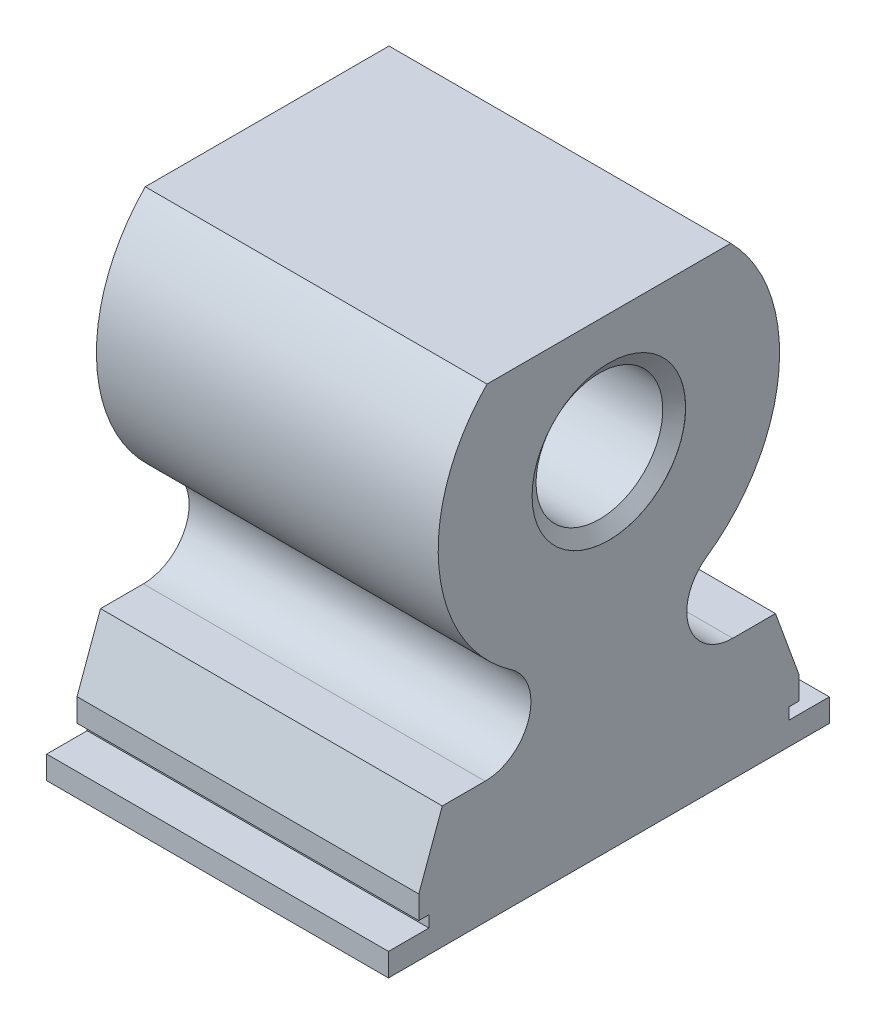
ISO-10303-21;
HEADER;
FILE_DESCRIPTION(('STEP AP214'),'2;1');
FILE_NAME('part.step','',(''),(''),'','','');
FILE_SCHEMA(('AUTOMOTIVE_DESIGN { 1 0 10303 214 1 1 1 1 }'));
ENDSEC;
DATA;
#1=APPLICATION_CONTEXT('core data for automotive mechanical design processes');
#2=APPLICATION_PROTOCOL_DEFINITION('international standard','automotive_design',2000,#1);
#3=PRODUCT_CONTEXT('',#1,'mechanical');
#4=PRODUCT('Part','Part','',(#3));
#5=PRODUCT_RELATED_PRODUCT_CATEGORY('part','',(#4));
#6=PRODUCT_DEFINITION_FORMATION('','',#4);
#7=PRODUCT_DEFINITION_CONTEXT('part definition',#1,'design');
#8=PRODUCT_DEFINITION('design','',#6,#7);
#9=PRODUCT_DEFINITION_SHAPE('','',#8);
#10=(LENGTH_UNIT() NAMED_UNIT(*) SI_UNIT(.MILLI.,.METRE.));
#11=(NAMED_UNIT(*) PLANE_ANGLE_UNIT() SI_UNIT($,.RADIAN.));
#12=(NAMED_UNIT(*) SI_UNIT($,.STERADIAN.) SOLID_ANGLE_UNIT());
#13=UNCERTAINTY_MEASURE_WITH_UNIT(LENGTH_MEASURE(1.E-05),#10,'distance_accuracy_value','');
#14=(GEOMETRIC_REPRESENTATION_CONTEXT(3) GLOBAL_UNCERTAINTY_ASSIGNED_CONTEXT((#13)) GLOBAL_UNIT_ASSIGNED_CONTEXT((#10,
#11,#12)) REPRESENTATION_CONTEXT('',''));
#15=CARTESIAN_POINT('',(0.,0.,0.));
#16=DIRECTION('',(0.,0.,1.));
#17=DIRECTION('',(1.,0.,0.));
#18=AXIS2_PLACEMENT_3D('',#15,#16,#17);
#19=CARTESIAN_POINT('',(8.9,0.,0.));
#20=DIRECTION('',(-1.,0.,0.));
#21=DIRECTION('',(0.,0.,1.));
#22=AXIS2_PLACEMENT_3D('',#19,#20,#21);
#23=CYLINDRICAL_SURFACE('',#22,4.445);
#24=CARTESIAN_POINT('',(8.9,0.,0.));
#25=DIRECTION('',(1.,0.,0.));
#26=DIRECTION('',(0.,0.,-1.));
#27=AXIS2_PLACEMENT_3D('',#24,#25,#26);
#28=CIRCLE('',#27,4.445);
#29=CARTESIAN_POINT('',(8.9,3.1115,3.1743649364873));
#30=VERTEX_POINT('',#29);
#31=CARTESIAN_POINT('',(8.9,-3.64692729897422,2.5412489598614));
#32=VERTEX_POINT('',#31);
#33=EDGE_CURVE('E313',#30,#32,#28,.T.);
#34=ORIENTED_EDGE('',*,*,#33,.F.);
#35=DIRECTION('',(-1.,0.,0.));
#36=VECTOR('',#35,1.);
#37=CARTESIAN_POINT('',(8.9,3.1115,3.1743649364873));
#38=LINE('',#37,#36);
#39=CARTESIAN_POINT('',(0.,3.1115,3.1743649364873));
#40=VERTEX_POINT('',#39);
#41=EDGE_CURVE('E11',#30,#40,#38,.T.);
#42=ORIENTED_EDGE('',*,*,#41,.T.);
#43=CARTESIAN_POINT('',(0.,0.,0.));
#44=DIRECTION('',(1.,0.,0.));
#45=DIRECTION('',(0.,0.,-1.));
#46=AXIS2_PLACEMENT_3D('',#43,#44,#45);
#47=CIRCLE('',#46,4.445);
#48=CARTESIAN_POINT('',(0.,-3.64692729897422,2.5412489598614));
#49=VERTEX_POINT('',#48);
#50=EDGE_CURVE('E232',#40,#49,#47,.T.);
#51=ORIENTED_EDGE('',*,*,#50,.T.);
#52=DIRECTION('',(-1.,0.,0.));
#53=VECTOR('',#52,1.);
#54=CARTESIAN_POINT('',(8.9,-3.64692729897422,2.5412489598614));
#55=LINE('',#54,#53);
#56=EDGE_CURVE('E261',#32,#49,#55,.T.);
#57=ORIENTED_EDGE('',*,*,#56,.F.);
#58=EDGE_LOOP('',(#34,#42,#51,#57));
#59=FACE_BOUND('',#58,.T.);
#60=ADVANCED_FACE('F39',(#59),#23,.T.);
#61=CARTESIAN_POINT('',(8.9,0.,0.));
#62=DIRECTION('',(-1.,0.,0.));
#63=DIRECTION('',(0.,0.,1.));
#64=AXIS2_PLACEMENT_3D('',#61,#62,#63);
#65=CYLINDRICAL_SURFACE('',#64,1.65);
#66=CARTESIAN_POINT('',(0.247521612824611,0.,0.));
#67=DIRECTION('',(-1.,0.,0.));
#68=DIRECTION('',(0.,0.,1.));
#69=AXIS2_PLACEMENT_3D('',#66,#67,#68);
#70=CIRCLE('',#69,1.65);
#71=CARTESIAN_POINT('',(0.247521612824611,0.,1.65));
#72=VERTEX_POINT('',#71);
#73=EDGE_CURVE('E295',#72,#72,#70,.T.);
#74=ORIENTED_EDGE('',*,*,#73,.T.);
#75=EDGE_LOOP('',(#74));
#76=FACE_BOUND('',#75,.T.);
#77=CARTESIAN_POINT('',(8.65247838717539,0.,0.));
#78=DIRECTION('',(-1.,0.,0.));
#79=DIRECTION('',(0.,0.,1.));
#80=AXIS2_PLACEMENT_3D('',#77,#78,#79);
#81=CIRCLE('',#80,1.65);
#82=CARTESIAN_POINT('',(8.65247838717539,0.,1.65));
#83=VERTEX_POINT('',#82);
#84=EDGE_CURVE('E373',#83,#83,#81,.T.);
#85=ORIENTED_EDGE('',*,*,#84,.F.);
#86=EDGE_LOOP('',(#85));
#87=FACE_BOUND('',#86,.T.);
#88=ADVANCED_FACE('F385',(#76,#87),#65,.F.);
#89=CARTESIAN_POINT('',(8.9,-4.62630314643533,3.22369685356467));
#90=DIRECTION('',(-1.,0.,0.));
#91=DIRECTION('',(0.,0.,1.));
#92=AXIS2_PLACEMENT_3D('',#89,#90,#91);
#93=PLANE('',#92);
#94=CARTESIAN_POINT('',(8.9,-3.64692729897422,-2.5412489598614));
#95=VERTEX_POINT('',#94);
#96=CARTESIAN_POINT('',(8.9,3.1115,-3.1743649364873));
#97=VERTEX_POINT('',#96);
#98=EDGE_CURVE('E303',#95,#97,#28,.T.);
#99=ORIENTED_EDGE('',*,*,#98,.T.);
#100=DIRECTION('',(0.,0.,1.));
#101=VECTOR('',#100,1.);
#102=CARTESIAN_POINT('',(8.9,3.1115,-4.445));
#103=LINE('',#102,#101);
#104=EDGE_CURVE('E54',#97,#30,#103,.T.);
#105=ORIENTED_EDGE('',*,*,#104,.T.);
#106=ORIENTED_EDGE('',*,*,#33,.T.);
#107=CARTESIAN_POINT('',(8.9,-4.62630314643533,3.22369685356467));
#108=DIRECTION('',(-1.,0.,0.));
#109=DIRECTION('',(0.,0.,1.));
#110=AXIS2_PLACEMENT_3D('',#107,#108,#109);
#111=CIRCLE('',#110,1.19369685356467);
#112=CARTESIAN_POINT('',(8.9,-5.82,3.22369685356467));
#113=VERTEX_POINT('',#112);
#114=EDGE_CURVE('E312',#32,#113,#111,.T.);
#115=ORIENTED_EDGE('',*,*,#114,.T.);
#116=DIRECTION('',(0.,0.,1.));
#117=VECTOR('',#116,1.);
#118=CARTESIAN_POINT('',(8.9,-5.82,3.22369685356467));
#119=LINE('',#118,#117);
#120=CARTESIAN_POINT('',(8.9,-5.82,4.33853000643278));
#121=VERTEX_POINT('',#120);
#122=EDGE_CURVE('E315',#113,#121,#119,.T.);
#123=ORIENTED_EDGE('',*,*,#122,.T.);
#124=DIRECTION('',(0.,-0.939692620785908,0.342020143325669));
#125=VECTOR('',#124,1.);
#126=CARTESIAN_POINT('',(8.9,-5.82,4.33853000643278));
#127=LINE('',#126,#125);
#128=CARTESIAN_POINT('',(8.9,-7.5,4.95));
#129=VERTEX_POINT('',#128);
#130=EDGE_CURVE('E321',#121,#129,#127,.T.);
#131=ORIENTED_EDGE('',*,*,#130,.T.);
#132=DIRECTION('',(0.,-1.,0.));
#133=VECTOR('',#132,1.);
#134=CARTESIAN_POINT('',(8.9,-7.5,4.95));
#135=LINE('',#134,#133);
#136=CARTESIAN_POINT('',(8.9,-8.1,4.95));
#137=VERTEX_POINT('',#136);
#138=EDGE_CURVE('E189',#129,#137,#135,.T.);
#139=ORIENTED_EDGE('',*,*,#138,.T.);
#140=DIRECTION('',(0.,0.,-1.));
#141=VECTOR('',#140,1.);
#142=CARTESIAN_POINT('',(8.9,-8.1,4.68666666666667));
#143=LINE('',#142,#141);
#144=CARTESIAN_POINT('',(8.9,-8.1,4.68666666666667));
#145=VERTEX_POINT('',#144);
#146=EDGE_CURVE('E180',#137,#145,#143,.T.);
#147=ORIENTED_EDGE('',*,*,#146,.T.);
#148=DIRECTION('',(0.,-1.,0.));
#149=VECTOR('',#148,1.);
#150=CARTESIAN_POINT('',(8.9,-8.4,4.68666666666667));
#151=LINE('',#150,#149);
#152=CARTESIAN_POINT('',(8.9,-8.4,4.68666666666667));
#153=VERTEX_POINT('',#152);
#154=EDGE_CURVE('E186',#145,#153,#151,.T.);
#155=ORIENTED_EDGE('',*,*,#154,.T.);
#156=DIRECTION('',(0.,0.,1.));
#157=VECTOR('',#156,1.);
#158=CARTESIAN_POINT('',(8.9,-8.4,5.74));
#159=LINE('',#158,#157);
#160=CARTESIAN_POINT('',(8.9,-8.4,5.74));
#161=VERTEX_POINT('',#160);
#162=EDGE_CURVE('E63',#153,#161,#159,.T.);
#163=ORIENTED_EDGE('',*,*,#162,.T.);
#164=DIRECTION('',(0.,-1.,0.));
#165=VECTOR('',#164,1.);
#166=CARTESIAN_POINT('',(8.9,-9.,5.74));
#167=LINE('',#166,#165);
#168=CARTESIAN_POINT('',(8.9,-9.,5.74));
#169=VERTEX_POINT('',#168);
#170=EDGE_CURVE('E248',#161,#169,#167,.T.);
#171=ORIENTED_EDGE('',*,*,#170,.T.);
#172=DIRECTION('',(0.,0.,-1.));
#173=VECTOR('',#172,1.);
#174=CARTESIAN_POINT('',(8.9,-9.,5.74));
#175=LINE('',#174,#173);
#176=CARTESIAN_POINT('',(8.9,-9.,-5.74));
#177=VERTEX_POINT('',#176);
#178=EDGE_CURVE('E135',#169,#177,#175,.T.);
#179=ORIENTED_EDGE('',*,*,#178,.T.);
#180=DIRECTION('',(0.,1.,0.));
#181=VECTOR('',#180,1.);
#182=CARTESIAN_POINT('',(8.9,-9.,-5.74));
#183=LINE('',#182,#181);
#184=CARTESIAN_POINT('',(8.9,-8.4,-5.74));
#185=VERTEX_POINT('',#184);
#186=EDGE_CURVE('E341',#177,#185,#183,.T.);
#187=ORIENTED_EDGE('',*,*,#186,.T.);
#188=DIRECTION('',(0.,0.,1.));
#189=VECTOR('',#188,1.);
#190=CARTESIAN_POINT('',(8.9,-8.4,-5.74));
#191=LINE('',#190,#189);
#192=CARTESIAN_POINT('',(8.9,-8.4,-4.68666666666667));
#193=VERTEX_POINT('',#192);
#194=EDGE_CURVE('E347',#185,#193,#191,.T.);
#195=ORIENTED_EDGE('',*,*,#194,.T.);
#196=DIRECTION('',(0.,1.,0.));
#197=VECTOR('',#196,1.);
#198=CARTESIAN_POINT('',(8.9,-8.4,-4.68666666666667));
#199=LINE('',#198,#197);
#200=CARTESIAN_POINT('',(8.9,-8.1,-4.68666666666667));
#201=VERTEX_POINT('',#200);
#202=EDGE_CURVE('E349',#193,#201,#199,.T.);
#203=ORIENTED_EDGE('',*,*,#202,.T.);
#204=DIRECTION('',(0.,0.,-1.));
#205=VECTOR('',#204,1.);
#206=CARTESIAN_POINT('',(8.9,-8.1,-4.68666666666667));
#207=LINE('',#206,#205);
#208=CARTESIAN_POINT('',(8.9,-8.1,-4.95));
#209=VERTEX_POINT('',#208);
#210=EDGE_CURVE('E351',#201,#209,#207,.T.);
#211=ORIENTED_EDGE('',*,*,#210,.T.);
#212=DIRECTION('',(0.,1.,0.));
#213=VECTOR('',#212,1.);
#214=CARTESIAN_POINT('',(8.9,-7.5,-4.95));
#215=LINE('',#214,#213);
#216=CARTESIAN_POINT('',(8.9,-7.5,-4.95));
#217=VERTEX_POINT('',#216);
#218=EDGE_CURVE('E353',#209,#217,#215,.T.);
#219=ORIENTED_EDGE('',*,*,#218,.T.);
#220=DIRECTION('',(0.,0.939692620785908,0.342020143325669));
#221=VECTOR('',#220,1.);
#222=CARTESIAN_POINT('',(8.9,-5.82,-4.33853000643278));
#223=LINE('',#222,#221);
#224=CARTESIAN_POINT('',(8.9,-5.82,-4.33853000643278));
#225=VERTEX_POINT('',#224);
#226=EDGE_CURVE('E355',#217,#225,#223,.T.);
#227=ORIENTED_EDGE('',*,*,#226,.T.);
#228=DIRECTION('',(0.,0.,1.));
#229=VECTOR('',#228,1.);
#230=CARTESIAN_POINT('',(8.9,-5.82,-4.33853000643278));
#231=LINE('',#230,#229);
#232=CARTESIAN_POINT('',(8.9,-5.82,-3.22369685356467));
#233=VERTEX_POINT('',#232);
#234=EDGE_CURVE('E356',#225,#233,#231,.T.);
#235=ORIENTED_EDGE('',*,*,#234,.T.);
#236=CARTESIAN_POINT('',(8.9,-4.62630314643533,-3.22369685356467));
#237=DIRECTION('',(-1.,0.,0.));
#238=DIRECTION('',(0.,0.,1.));
#239=AXIS2_PLACEMENT_3D('',#236,#237,#238);
#240=CIRCLE('',#239,1.19369685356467);
#241=EDGE_CURVE('E310',#233,#95,#240,.T.);
#242=ORIENTED_EDGE('',*,*,#241,.T.);
#243=EDGE_LOOP('',(#99,#105,#106,#115,#123,#131,#139,#147,#155,#163,#171,#179,#187,#195,#203,
#211,#219,#227,#235,#242));
#244=FACE_BOUND('',#243,.T.);
#245=CARTESIAN_POINT('',(8.9,0.,0.));
#246=DIRECTION('',(-1.,0.,0.));
#247=DIRECTION('',(0.,0.,1.));
#248=AXIS2_PLACEMENT_3D('',#245,#246,#247);
#249=CIRCLE('',#248,2.);
#250=CARTESIAN_POINT('',(8.9,0.,2.));
#251=VERTEX_POINT('',#250);
#252=EDGE_CURVE('E296',#251,#251,#249,.F.);
#253=ORIENTED_EDGE('',*,*,#252,.F.);
#254=EDGE_LOOP('',(#253));
#255=FACE_BOUND('',#254,.T.);
#256=ADVANCED_FACE('F183',(#244,#255),#93,.F.);
#257=CARTESIAN_POINT('',(0.,-4.62630314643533,3.22369685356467));
#258=DIRECTION('',(-1.,0.,0.));
#259=DIRECTION('',(0.,0.,1.));
#260=AXIS2_PLACEMENT_3D('',#257,#258,#259);
#261=PLANE('',#260);
#262=DIRECTION('',(0.,0.,1.));
#263=VECTOR('',#262,1.);
#264=CARTESIAN_POINT('',(0.,3.1115,-4.445));
#265=LINE('',#264,#263);
#266=CARTESIAN_POINT('',(0.,3.1115,-3.1743649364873));
#267=VERTEX_POINT('',#266);
#268=EDGE_CURVE('E368',#267,#40,#265,.T.);
#269=ORIENTED_EDGE('',*,*,#268,.F.);
#270=CARTESIAN_POINT('',(0.,-3.64692729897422,-2.5412489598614));
#271=VERTEX_POINT('',#270);
#272=EDGE_CURVE('E233',#271,#267,#47,.T.);
#273=ORIENTED_EDGE('',*,*,#272,.F.);
#274=CARTESIAN_POINT('',(0.,-4.62630314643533,-3.22369685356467));
#275=DIRECTION('',(-1.,0.,0.));
#276=DIRECTION('',(0.,0.,1.));
#277=AXIS2_PLACEMENT_3D('',#274,#275,#276);
#278=CIRCLE('',#277,1.19369685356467);
#279=CARTESIAN_POINT('',(0.,-5.82,-3.22369685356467));
#280=VERTEX_POINT('',#279);
#281=EDGE_CURVE('E230',#280,#271,#278,.T.);
#282=ORIENTED_EDGE('',*,*,#281,.F.);
#283=DIRECTION('',(0.,0.,1.));
#284=VECTOR('',#283,1.);
#285=CARTESIAN_POINT('',(0.,-5.82,-4.33853000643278));
#286=LINE('',#285,#284);
#287=CARTESIAN_POINT('',(0.,-5.82,-4.33853000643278));
#288=VERTEX_POINT('',#287);
#289=EDGE_CURVE('E228',#288,#280,#286,.T.);
#290=ORIENTED_EDGE('',*,*,#289,.F.);
#291=DIRECTION('',(0.,0.939692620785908,0.342020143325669));
#292=VECTOR('',#291,1.);
#293=CARTESIAN_POINT('',(0.,-5.82,-4.33853000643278));
#294=LINE('',#293,#292);
#295=CARTESIAN_POINT('',(0.,-7.5,-4.95));
#296=VERTEX_POINT('',#295);
#297=EDGE_CURVE('E226',#296,#288,#294,.T.);
#298=ORIENTED_EDGE('',*,*,#297,.F.);
#299=DIRECTION('',(0.,1.,0.));
#300=VECTOR('',#299,1.);
#301=CARTESIAN_POINT('',(0.,-7.5,-4.95));
#302=LINE('',#301,#300);
#303=CARTESIAN_POINT('',(0.,-8.1,-4.95));
#304=VERTEX_POINT('',#303);
#305=EDGE_CURVE('E224',#304,#296,#302,.T.);
#306=ORIENTED_EDGE('',*,*,#305,.F.);
#307=DIRECTION('',(0.,0.,-1.));
#308=VECTOR('',#307,1.);
#309=CARTESIAN_POINT('',(0.,-8.1,-4.68666666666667));
#310=LINE('',#309,#308);
#311=CARTESIAN_POINT('',(0.,-8.1,-4.68666666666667));
#312=VERTEX_POINT('',#311);
#313=EDGE_CURVE('E222',#312,#304,#310,.T.);
#314=ORIENTED_EDGE('',*,*,#313,.F.);
#315=DIRECTION('',(0.,1.,0.));
#316=VECTOR('',#315,1.);
#317=CARTESIAN_POINT('',(0.,-8.4,-4.68666666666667));
#318=LINE('',#317,#316);
#319=CARTESIAN_POINT('',(0.,-8.4,-4.68666666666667));
#320=VERTEX_POINT('',#319);
#321=EDGE_CURVE('E220',#320,#312,#318,.T.);
#322=ORIENTED_EDGE('',*,*,#321,.F.);
#323=DIRECTION('',(0.,0.,1.));
#324=VECTOR('',#323,1.);
#325=CARTESIAN_POINT('',(0.,-8.4,-5.74));
#326=LINE('',#325,#324);
#327=CARTESIAN_POINT('',(0.,-8.4,-5.74));
#328=VERTEX_POINT('',#327);
#329=EDGE_CURVE('E218',#328,#320,#326,.T.);
#330=ORIENTED_EDGE('',*,*,#329,.F.);
#331=DIRECTION('',(0.,1.,0.));
#332=VECTOR('',#331,1.);
#333=CARTESIAN_POINT('',(0.,-9.,-5.74));
#334=LINE('',#333,#332);
#335=CARTESIAN_POINT('',(0.,-9.,-5.74));
#336=VERTEX_POINT('',#335);
#337=EDGE_CURVE('E216',#336,#328,#334,.T.);
#338=ORIENTED_EDGE('',*,*,#337,.F.);
#339=DIRECTION('',(0.,0.,-1.));
#340=VECTOR('',#339,1.);
#341=CARTESIAN_POINT('',(0.,-9.,5.74));
#342=LINE('',#341,#340);
#343=CARTESIAN_POINT('',(0.,-9.,5.74));
#344=VERTEX_POINT('',#343);
#345=EDGE_CURVE('E213',#344,#336,#342,.T.);
#346=ORIENTED_EDGE('',*,*,#345,.F.);
#347=DIRECTION('',(0.,-1.,0.));
#348=VECTOR('',#347,1.);
#349=CARTESIAN_POINT('',(0.,-9.,5.74));
#350=LINE('',#349,#348);
#351=CARTESIAN_POINT('',(0.,-8.4,5.74));
#352=VERTEX_POINT('',#351);
#353=EDGE_CURVE('E210',#352,#344,#350,.T.);
#354=ORIENTED_EDGE('',*,*,#353,.F.);
#355=DIRECTION('',(0.,0.,1.));
#356=VECTOR('',#355,1.);
#357=CARTESIAN_POINT('',(0.,-8.4,5.74));
#358=LINE('',#357,#356);
#359=CARTESIAN_POINT('',(0.,-8.4,4.68666666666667));
#360=VERTEX_POINT('',#359);
#361=EDGE_CURVE('E126',#360,#352,#358,.T.);
#362=ORIENTED_EDGE('',*,*,#361,.F.);
#363=DIRECTION('',(0.,-1.,0.));
#364=VECTOR('',#363,1.);
#365=CARTESIAN_POINT('',(0.,-8.4,4.68666666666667));
#366=LINE('',#365,#364);
#367=CARTESIAN_POINT('',(0.,-8.1,4.68666666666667));
#368=VERTEX_POINT('',#367);
#369=EDGE_CURVE('E245',#368,#360,#366,.T.);
#370=ORIENTED_EDGE('',*,*,#369,.F.);
#371=DIRECTION('',(0.,0.,-1.));
#372=VECTOR('',#371,1.);
#373=CARTESIAN_POINT('',(0.,-8.1,4.68666666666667));
#374=LINE('',#373,#372);
#375=CARTESIAN_POINT('',(0.,-8.1,4.95));
#376=VERTEX_POINT('',#375);
#377=EDGE_CURVE('E198',#376,#368,#374,.T.);
#378=ORIENTED_EDGE('',*,*,#377,.F.);
#379=DIRECTION('',(0.,-1.,0.));
#380=VECTOR('',#379,1.);
#381=CARTESIAN_POINT('',(0.,-7.5,4.95));
#382=LINE('',#381,#380);
#383=CARTESIAN_POINT('',(0.,-7.5,4.95));
#384=VERTEX_POINT('',#383);
#385=EDGE_CURVE('E242',#384,#376,#382,.T.);
#386=ORIENTED_EDGE('',*,*,#385,.F.);
#387=DIRECTION('',(0.,-0.939692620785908,0.342020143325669));
#388=VECTOR('',#387,1.);
#389=CARTESIAN_POINT('',(0.,-5.82,4.33853000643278));
#390=LINE('',#389,#388);
#391=CARTESIAN_POINT('',(0.,-5.82,4.33853000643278));
#392=VERTEX_POINT('',#391);
#393=EDGE_CURVE('E240',#392,#384,#390,.T.);
#394=ORIENTED_EDGE('',*,*,#393,.F.);
#395=DIRECTION('',(0.,0.,1.));
#396=VECTOR('',#395,1.);
#397=CARTESIAN_POINT('',(0.,-5.82,3.22369685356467));
#398=LINE('',#397,#396);
#399=CARTESIAN_POINT('',(0.,-5.82,3.22369685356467));
#400=VERTEX_POINT('',#399);
#401=EDGE_CURVE('E238',#400,#392,#398,.T.);
#402=ORIENTED_EDGE('',*,*,#401,.F.);
#403=CARTESIAN_POINT('',(0.,-4.62630314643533,3.22369685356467));
#404=DIRECTION('',(-1.,0.,0.));
#405=DIRECTION('',(0.,0.,1.));
#406=AXIS2_PLACEMENT_3D('',#403,#404,#405);
#407=CIRCLE('',#406,1.19369685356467);
#408=EDGE_CURVE('E236',#49,#400,#407,.T.);
#409=ORIENTED_EDGE('',*,*,#408,.F.);
#410=ORIENTED_EDGE('',*,*,#50,.F.);
#411=EDGE_LOOP('',(#269,#273,#282,#290,#298,#306,#314,#322,#330,#338,#346,#354,#362,#370,#378,
#386,#394,#402,#409,#410));
#412=FACE_BOUND('',#411,.T.);
#413=CARTESIAN_POINT('',(0.,0.,0.));
#414=DIRECTION('',(-1.,0.,0.));
#415=DIRECTION('',(0.,0.,1.));
#416=AXIS2_PLACEMENT_3D('',#413,#414,#415);
#417=CIRCLE('',#416,2.);
#418=CARTESIAN_POINT('',(0.,0.,2.));
#419=VERTEX_POINT('',#418);
#420=EDGE_CURVE('E214',#419,#419,#417,.F.);
#421=ORIENTED_EDGE('',*,*,#420,.T.);
#422=EDGE_LOOP('',(#421));
#423=FACE_BOUND('',#422,.T.);
#424=ADVANCED_FACE('F333',(#412,#423),#261,.T.);
#425=CARTESIAN_POINT('',(8.9,-9.,5.74));
#426=DIRECTION('',(0.,0.,-1.));
#427=DIRECTION('',(0.,1.,0.));
#428=AXIS2_PLACEMENT_3D('',#425,#426,#427);
#429=PLANE('',#428);
#430=ORIENTED_EDGE('',*,*,#353,.T.);
#431=DIRECTION('',(-1.,0.,0.));
#432=VECTOR('',#431,1.);
#433=CARTESIAN_POINT('',(8.9,-9.,5.74));
#434=LINE('',#433,#432);
#435=EDGE_CURVE('E291',#169,#344,#434,.T.);
#436=ORIENTED_EDGE('',*,*,#435,.F.);
#437=ORIENTED_EDGE('',*,*,#170,.F.);
#438=DIRECTION('',(-1.,0.,0.));
#439=VECTOR('',#438,1.);
#440=CARTESIAN_POINT('',(8.9,-8.4,5.74));
#441=LINE('',#440,#439);
#442=EDGE_CURVE('E206',#161,#352,#441,.T.);
#443=ORIENTED_EDGE('',*,*,#442,.T.);
#444=EDGE_LOOP('',(#430,#436,#437,#443));
#445=FACE_BOUND('',#444,.T.);
#446=ADVANCED_FACE('F41',(#445),#429,.F.);
#447=CARTESIAN_POINT('',(8.9,-9.,5.74));
#448=DIRECTION('',(0.,1.,0.));
#449=DIRECTION('',(0.,0.,1.));
#450=AXIS2_PLACEMENT_3D('',#447,#448,#449);
#451=PLANE('',#450);
#452=ORIENTED_EDGE('',*,*,#345,.T.);
#453=DIRECTION('',(-1.,0.,0.));
#454=VECTOR('',#453,1.);
#455=CARTESIAN_POINT('',(8.9,-9.,-5.74));
#456=LINE('',#455,#454);
#457=EDGE_CURVE('E288',#177,#336,#456,.T.);
#458=ORIENTED_EDGE('',*,*,#457,.F.);
#459=ORIENTED_EDGE('',*,*,#178,.F.);
#460=ORIENTED_EDGE('',*,*,#435,.T.);
#461=EDGE_LOOP('',(#452,#458,#459,#460));
#462=FACE_BOUND('',#461,.T.);
#463=ADVANCED_FACE('F448',(#462),#451,.F.);
#464=CARTESIAN_POINT('',(8.9,-9.,-5.74));
#465=DIRECTION('',(0.,0.,1.));
#466=DIRECTION('',(0.,-1.,0.));
#467=AXIS2_PLACEMENT_3D('',#464,#465,#466);
#468=PLANE('',#467);
#469=ORIENTED_EDGE('',*,*,#337,.T.);
#470=DIRECTION('',(-1.,0.,0.));
#471=VECTOR('',#470,1.);
#472=CARTESIAN_POINT('',(8.9,-8.4,-5.74));
#473=LINE('',#472,#471);
#474=EDGE_CURVE('E285',#185,#328,#473,.T.);
#475=ORIENTED_EDGE('',*,*,#474,.F.);
#476=ORIENTED_EDGE('',*,*,#186,.F.);
#477=ORIENTED_EDGE('',*,*,#457,.T.);
#478=EDGE_LOOP('',(#469,#475,#476,#477));
#479=FACE_BOUND('',#478,.T.);
#480=ADVANCED_FACE('F445',(#479),#468,.F.);
#481=CARTESIAN_POINT('',(8.9,-8.4,-5.74));
#482=DIRECTION('',(0.,-1.,0.));
#483=DIRECTION('',(0.,0.,-1.));
#484=AXIS2_PLACEMENT_3D('',#481,#482,#483);
#485=PLANE('',#484);
#486=ORIENTED_EDGE('',*,*,#329,.T.);
#487=DIRECTION('',(-1.,0.,0.));
#488=VECTOR('',#487,1.);
#489=CARTESIAN_POINT('',(8.9,-8.4,-4.68666666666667));
#490=LINE('',#489,#488);
#491=EDGE_CURVE('E282',#193,#320,#490,.T.);
#492=ORIENTED_EDGE('',*,*,#491,.F.);
#493=ORIENTED_EDGE('',*,*,#194,.F.);
#494=ORIENTED_EDGE('',*,*,#474,.T.);
#495=EDGE_LOOP('',(#486,#492,#493,#494));
#496=FACE_BOUND('',#495,.T.);
#497=ADVANCED_FACE('F441',(#496),#485,.F.);
#498=CARTESIAN_POINT('',(8.9,-8.4,-4.68666666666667));
#499=DIRECTION('',(0.,0.,1.));
#500=DIRECTION('',(0.,-1.,0.));
#501=AXIS2_PLACEMENT_3D('',#498,#499,#500);
#502=PLANE('',#501);
#503=ORIENTED_EDGE('',*,*,#321,.T.);
#504=DIRECTION('',(-1.,0.,0.));
#505=VECTOR('',#504,1.);
#506=CARTESIAN_POINT('',(8.9,-8.1,-4.68666666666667));
#507=LINE('',#506,#505);
#508=EDGE_CURVE('E279',#201,#312,#507,.T.);
#509=ORIENTED_EDGE('',*,*,#508,.F.);
#510=ORIENTED_EDGE('',*,*,#202,.F.);
#511=ORIENTED_EDGE('',*,*,#491,.T.);
#512=EDGE_LOOP('',(#503,#509,#510,#511));
#513=FACE_BOUND('',#512,.T.);
#514=ADVANCED_FACE('F437',(#513),#502,.F.);
#515=CARTESIAN_POINT('',(8.9,-8.1,-4.68666666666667));
#516=DIRECTION('',(0.,1.,0.));
#517=DIRECTION('',(0.,0.,1.));
#518=AXIS2_PLACEMENT_3D('',#515,#516,#517);
#519=PLANE('',#518);
#520=ORIENTED_EDGE('',*,*,#313,.T.);
#521=DIRECTION('',(-1.,0.,0.));
#522=VECTOR('',#521,1.);
#523=CARTESIAN_POINT('',(8.9,-8.1,-4.95));
#524=LINE('',#523,#522);
#525=EDGE_CURVE('E276',#209,#304,#524,.T.);
#526=ORIENTED_EDGE('',*,*,#525,.F.);
#527=ORIENTED_EDGE('',*,*,#210,.F.);
#528=ORIENTED_EDGE('',*,*,#508,.T.);
#529=EDGE_LOOP('',(#520,#526,#527,#528));
#530=FACE_BOUND('',#529,.T.);
#531=ADVANCED_FACE('F433',(#530),#519,.F.);
#532=CARTESIAN_POINT('',(8.9,-7.5,-4.95));
#533=DIRECTION('',(0.,0.,1.));
#534=DIRECTION('',(1.,0.,0.));
#535=AXIS2_PLACEMENT_3D('',#532,#533,#534);
#536=PLANE('',#535);
#537=ORIENTED_EDGE('',*,*,#305,.T.);
#538=DIRECTION('',(-1.,0.,0.));
#539=VECTOR('',#538,1.);
#540=CARTESIAN_POINT('',(8.9,-7.5,-4.95));
#541=LINE('',#540,#539);
#542=EDGE_CURVE('E273',#217,#296,#541,.T.);
#543=ORIENTED_EDGE('',*,*,#542,.F.);
#544=ORIENTED_EDGE('',*,*,#218,.F.);
#545=ORIENTED_EDGE('',*,*,#525,.T.);
#546=EDGE_LOOP('',(#537,#543,#544,#545));
#547=FACE_BOUND('',#546,.T.);
#548=ADVANCED_FACE('F429',(#547),#536,.F.);
#549=CARTESIAN_POINT('',(8.9,-5.82,-4.33853000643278));
#550=DIRECTION('',(0.,-0.342020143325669,0.939692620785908));
#551=DIRECTION('',(0.,-0.939692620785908,-0.342020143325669));
#552=AXIS2_PLACEMENT_3D('',#549,#550,#551);
#553=PLANE('',#552);
#554=ORIENTED_EDGE('',*,*,#297,.T.);
#555=DIRECTION('',(-1.,0.,0.));
#556=VECTOR('',#555,1.);
#557=CARTESIAN_POINT('',(8.9,-5.82,-4.33853000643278));
#558=LINE('',#557,#556);
#559=EDGE_CURVE('E270',#225,#288,#558,.T.);
#560=ORIENTED_EDGE('',*,*,#559,.F.);
#561=ORIENTED_EDGE('',*,*,#226,.F.);
#562=ORIENTED_EDGE('',*,*,#542,.T.);
#563=EDGE_LOOP('',(#554,#560,#561,#562));
#564=FACE_BOUND('',#563,.T.);
#565=ADVANCED_FACE('F424',(#564),#553,.F.);
#566=CARTESIAN_POINT('',(8.9,-5.82,-4.33853000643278));
#567=DIRECTION('',(0.,-1.,0.));
#568=DIRECTION('',(0.,0.,-1.));
#569=AXIS2_PLACEMENT_3D('',#566,#567,#568);
#570=PLANE('',#569);
#571=ORIENTED_EDGE('',*,*,#289,.T.);
#572=DIRECTION('',(-1.,0.,0.));
#573=VECTOR('',#572,1.);
#574=CARTESIAN_POINT('',(8.9,-5.82,-3.22369685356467));
#575=LINE('',#574,#573);
#576=EDGE_CURVE('E267',#233,#280,#575,.T.);
#577=ORIENTED_EDGE('',*,*,#576,.F.);
#578=ORIENTED_EDGE('',*,*,#234,.F.);
#579=ORIENTED_EDGE('',*,*,#559,.T.);
#580=EDGE_LOOP('',(#571,#577,#578,#579));
#581=FACE_BOUND('',#580,.T.);
#582=ADVANCED_FACE('F362',(#581),#570,.F.);
#583=CARTESIAN_POINT('',(8.9,-4.62630314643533,-3.22369685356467));
#584=DIRECTION('',(-1.,0.,0.));
#585=DIRECTION('',(0.,0.,1.));
#586=AXIS2_PLACEMENT_3D('',#583,#584,#585);
#587=CYLINDRICAL_SURFACE('',#586,1.19369685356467);
#588=ORIENTED_EDGE('',*,*,#281,.T.);
#589=DIRECTION('',(-1.,0.,0.));
#590=VECTOR('',#589,1.);
#591=CARTESIAN_POINT('',(8.9,-3.64692729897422,-2.5412489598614));
#592=LINE('',#591,#590);
#593=EDGE_CURVE('E264',#95,#271,#592,.T.);
#594=ORIENTED_EDGE('',*,*,#593,.F.);
#595=ORIENTED_EDGE('',*,*,#241,.F.);
#596=ORIENTED_EDGE('',*,*,#576,.T.);
#597=EDGE_LOOP('',(#588,#594,#595,#596));
#598=FACE_BOUND('',#597,.T.);
#599=ADVANCED_FACE('F366',(#598),#587,.F.);
#600=ORIENTED_EDGE('',*,*,#272,.T.);
#601=DIRECTION('',(-1.,0.,0.));
#602=VECTOR('',#601,1.);
#603=CARTESIAN_POINT('',(8.9,3.1115,-3.1743649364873));
#604=LINE('',#603,#602);
#605=EDGE_CURVE('E47',#267,#97,#604,.F.);
#606=ORIENTED_EDGE('',*,*,#605,.T.);
#607=ORIENTED_EDGE('',*,*,#98,.F.);
#608=ORIENTED_EDGE('',*,*,#593,.T.);
#609=EDGE_LOOP('',(#600,#606,#607,#608));
#610=FACE_BOUND('',#609,.T.);
#611=ADVANCED_FACE('F302',(#610),#23,.T.);
#612=CARTESIAN_POINT('',(8.9,-4.62630314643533,3.22369685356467));
#613=DIRECTION('',(-1.,0.,0.));
#614=DIRECTION('',(0.,0.,1.));
#615=AXIS2_PLACEMENT_3D('',#612,#613,#614);
#616=CYLINDRICAL_SURFACE('',#615,1.19369685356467);
#617=ORIENTED_EDGE('',*,*,#408,.T.);
#618=DIRECTION('',(-1.,0.,0.));
#619=VECTOR('',#618,1.);
#620=CARTESIAN_POINT('',(8.9,-5.82,3.22369685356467));
#621=LINE('',#620,#619);
#622=EDGE_CURVE('E258',#113,#400,#621,.T.);
#623=ORIENTED_EDGE('',*,*,#622,.F.);
#624=ORIENTED_EDGE('',*,*,#114,.F.);
#625=ORIENTED_EDGE('',*,*,#56,.T.);
#626=EDGE_LOOP('',(#617,#623,#624,#625));
#627=FACE_BOUND('',#626,.T.);
#628=ADVANCED_FACE('F412',(#627),#616,.F.);
#629=CARTESIAN_POINT('',(8.9,-5.82,3.22369685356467));
#630=DIRECTION('',(0.,-1.,0.));
#631=DIRECTION('',(0.,0.,-1.));
#632=AXIS2_PLACEMENT_3D('',#629,#630,#631);
#633=PLANE('',#632);
#634=ORIENTED_EDGE('',*,*,#401,.T.);
#635=DIRECTION('',(-1.,0.,0.));
#636=VECTOR('',#635,1.);
#637=CARTESIAN_POINT('',(8.9,-5.82,4.33853000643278));
#638=LINE('',#637,#636);
#639=EDGE_CURVE('E255',#121,#392,#638,.T.);
#640=ORIENTED_EDGE('',*,*,#639,.F.);
#641=ORIENTED_EDGE('',*,*,#122,.F.);
#642=ORIENTED_EDGE('',*,*,#622,.T.);
#643=EDGE_LOOP('',(#634,#640,#641,#642));
#644=FACE_BOUND('',#643,.T.);
#645=ADVANCED_FACE('F418',(#644),#633,.F.);
#646=CARTESIAN_POINT('',(8.9,-5.82,4.33853000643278));
#647=DIRECTION('',(0.,-0.342020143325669,-0.939692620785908));
#648=DIRECTION('',(0.,0.939692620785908,-0.342020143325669));
#649=AXIS2_PLACEMENT_3D('',#646,#647,#648);
#650=PLANE('',#649);
#651=ORIENTED_EDGE('',*,*,#393,.T.);
#652=DIRECTION('',(-1.,0.,0.));
#653=VECTOR('',#652,1.);
#654=CARTESIAN_POINT('',(8.9,-7.5,4.95));
#655=LINE('',#654,#653);
#656=EDGE_CURVE('E252',#129,#384,#655,.T.);
#657=ORIENTED_EDGE('',*,*,#656,.F.);
#658=ORIENTED_EDGE('',*,*,#130,.F.);
#659=ORIENTED_EDGE('',*,*,#639,.T.);
#660=EDGE_LOOP('',(#651,#657,#658,#659));
#661=FACE_BOUND('',#660,.T.);
#662=ADVANCED_FACE('F327',(#661),#650,.F.);
#663=CARTESIAN_POINT('',(8.9,-7.5,4.95));
#664=DIRECTION('',(0.,0.,-1.));
#665=DIRECTION('',(-1.,0.,0.));
#666=AXIS2_PLACEMENT_3D('',#663,#664,#665);
#667=PLANE('',#666);
#668=ORIENTED_EDGE('',*,*,#385,.T.);
#669=DIRECTION('',(-1.,0.,0.));
#670=VECTOR('',#669,1.);
#671=CARTESIAN_POINT('',(8.9,-8.1,4.95));
#672=LINE('',#671,#670);
#673=EDGE_CURVE('E201',#137,#376,#672,.T.);
#674=ORIENTED_EDGE('',*,*,#673,.F.);
#675=ORIENTED_EDGE('',*,*,#138,.F.);
#676=ORIENTED_EDGE('',*,*,#656,.T.);
#677=EDGE_LOOP('',(#668,#674,#675,#676));
#678=FACE_BOUND('',#677,.T.);
#679=ADVANCED_FACE('F331',(#678),#667,.F.);
#680=CARTESIAN_POINT('',(8.9,-8.1,4.68666666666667));
#681=DIRECTION('',(0.,1.,0.));
#682=DIRECTION('',(0.,0.,1.));
#683=AXIS2_PLACEMENT_3D('',#680,#681,#682);
#684=PLANE('',#683);
#685=ORIENTED_EDGE('',*,*,#377,.T.);
#686=DIRECTION('',(-1.,0.,0.));
#687=VECTOR('',#686,1.);
#688=CARTESIAN_POINT('',(8.9,-8.1,4.68666666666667));
#689=LINE('',#688,#687);
#690=EDGE_CURVE('E195',#145,#368,#689,.T.);
#691=ORIENTED_EDGE('',*,*,#690,.F.);
#692=ORIENTED_EDGE('',*,*,#146,.F.);
#693=ORIENTED_EDGE('',*,*,#673,.T.);
#694=EDGE_LOOP('',(#685,#691,#692,#693));
#695=FACE_BOUND('',#694,.T.);
#696=ADVANCED_FACE('F196',(#695),#684,.F.);
#697=CARTESIAN_POINT('',(8.9,-8.4,4.68666666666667));
#698=DIRECTION('',(0.,0.,-1.));
#699=DIRECTION('',(0.,1.,0.));
#700=AXIS2_PLACEMENT_3D('',#697,#698,#699);
#701=PLANE('',#700);
#702=ORIENTED_EDGE('',*,*,#369,.T.);
#703=DIRECTION('',(-1.,0.,0.));
#704=VECTOR('',#703,1.);
#705=CARTESIAN_POINT('',(8.9,-8.4,4.68666666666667));
#706=LINE('',#705,#704);
#707=EDGE_CURVE('E202',#153,#360,#706,.T.);
#708=ORIENTED_EDGE('',*,*,#707,.F.);
#709=ORIENTED_EDGE('',*,*,#154,.F.);
#710=ORIENTED_EDGE('',*,*,#690,.T.);
#711=EDGE_LOOP('',(#702,#708,#709,#710));
#712=FACE_BOUND('',#711,.T.);
#713=ADVANCED_FACE('F204',(#712),#701,.F.);
#714=CARTESIAN_POINT('',(8.9,-8.4,5.74));
#715=DIRECTION('',(0.,-1.,0.));
#716=DIRECTION('',(0.,0.,-1.));
#717=AXIS2_PLACEMENT_3D('',#714,#715,#716);
#718=PLANE('',#717);
#719=ORIENTED_EDGE('',*,*,#361,.T.);
#720=ORIENTED_EDGE('',*,*,#442,.F.);
#721=ORIENTED_EDGE('',*,*,#162,.F.);
#722=ORIENTED_EDGE('',*,*,#707,.T.);
#723=EDGE_LOOP('',(#719,#720,#721,#722));
#724=FACE_BOUND('',#723,.T.);
#725=ADVANCED_FACE('F336',(#724),#718,.F.);
#726=CARTESIAN_POINT('',(0.247521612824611,0.,0.));
#727=DIRECTION('',(-1.,0.,0.));
#728=DIRECTION('',(0.,0.,1.));
#729=AXIS2_PLACEMENT_3D('',#726,#727,#728);
#730=CONICAL_SURFACE('',#729,1.65,0.960105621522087);
#731=CARTESIAN_POINT('',(0.00254000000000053,0.,0.));
#732=DIRECTION('',(-1.,0.,0.));
#733=DIRECTION('',(0.,0.,1.));
#734=AXIS2_PLACEMENT_3D('',#731,#732,#733);
#735=CIRCLE('',#734,2.);
#736=CARTESIAN_POINT('',(0.00254000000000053,0.,2.));
#737=VERTEX_POINT('',#736);
#738=EDGE_CURVE('E298',#737,#737,#735,.T.);
#739=ORIENTED_EDGE('',*,*,#738,.T.);
#740=EDGE_LOOP('',(#739));
#741=FACE_BOUND('',#740,.T.);
#742=ORIENTED_EDGE('',*,*,#73,.F.);
#743=EDGE_LOOP('',(#742));
#744=FACE_BOUND('',#743,.T.);
#745=ADVANCED_FACE('F388',(#741,#744),#730,.F.);
#746=CARTESIAN_POINT('',(-5.10587962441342,0.,0.));
#747=DIRECTION('',(-1.,0.,0.));
#748=DIRECTION('',(0.,0.,1.));
#749=AXIS2_PLACEMENT_3D('',#746,#747,#748);
#750=CYLINDRICAL_SURFACE('',#749,2.);
#751=ORIENTED_EDGE('',*,*,#420,.F.);
#752=EDGE_LOOP('',(#751));
#753=FACE_BOUND('',#752,.T.);
#754=ORIENTED_EDGE('',*,*,#738,.F.);
#755=EDGE_LOOP('',(#754));
#756=FACE_BOUND('',#755,.T.);
#757=ADVANCED_FACE('F390',(#753,#756),#750,.F.);
#758=CARTESIAN_POINT('',(-5.10587962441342,0.,0.));
#759=DIRECTION('',(-1.,0.,0.));
#760=DIRECTION('',(0.,0.,1.));
#761=AXIS2_PLACEMENT_3D('',#758,#759,#760);
#762=CYLINDRICAL_SURFACE('',#761,2.);
#763=CARTESIAN_POINT('',(8.89746,0.,0.));
#764=DIRECTION('',(-1.,0.,0.));
#765=DIRECTION('',(0.,0.,1.));
#766=AXIS2_PLACEMENT_3D('',#763,#764,#765);
#767=CIRCLE('',#766,2.);
#768=CARTESIAN_POINT('',(8.89746,0.,2.));
#769=VERTEX_POINT('',#768);
#770=EDGE_CURVE('E299',#769,#769,#767,.T.);
#771=ORIENTED_EDGE('',*,*,#770,.T.);
#772=EDGE_LOOP('',(#771));
#773=FACE_BOUND('',#772,.T.);
#774=ORIENTED_EDGE('',*,*,#252,.T.);
#775=EDGE_LOOP('',(#774));
#776=FACE_BOUND('',#775,.T.);
#777=ADVANCED_FACE('F396',(#773,#776),#762,.F.);
#778=CARTESIAN_POINT('',(8.89746,0.,0.));
#779=DIRECTION('',(1.,0.,0.));
#780=DIRECTION('',(0.,0.,-1.));
#781=AXIS2_PLACEMENT_3D('',#778,#779,#780);
#782=CONICAL_SURFACE('',#781,2.,0.960105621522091);
#783=ORIENTED_EDGE('',*,*,#84,.T.);
#784=EDGE_LOOP('',(#783));
#785=FACE_BOUND('',#784,.T.);
#786=ORIENTED_EDGE('',*,*,#770,.F.);
#787=EDGE_LOOP('',(#786));
#788=FACE_BOUND('',#787,.T.);
#789=ADVANCED_FACE('F494',(#785,#788),#782,.F.);
#790=CARTESIAN_POINT('',(8.9,3.1115,-4.445));
#791=DIRECTION('',(0.,-1.,0.));
#792=DIRECTION('',(0.,0.,-1.));
#793=AXIS2_PLACEMENT_3D('',#790,#791,#792);
#794=PLANE('',#793);
#795=ORIENTED_EDGE('',*,*,#104,.F.);
#796=ORIENTED_EDGE('',*,*,#605,.F.);
#797=ORIENTED_EDGE('',*,*,#268,.T.);
#798=ORIENTED_EDGE('',*,*,#41,.F.);
#799=EDGE_LOOP('',(#795,#796,#797,#798));
#800=FACE_BOUND('',#799,.T.);
#801=ADVANCED_FACE('F493',(#800),#794,.F.);
#802=CLOSED_SHELL('',(#60,#88,#256,#424,#446,#463,#480,#497,#514,#531,#548,#565,#582,#599,#611,
#628,#645,#662,#679,#696,#713,#725,#745,#757,#777,#789,#801));
#803=MANIFOLD_SOLID_BREP('B2',#802);
#804=ADVANCED_BREP_SHAPE_REPRESENTATION('',(#18,#803),#14);
#805=SHAPE_DEFINITION_REPRESENTATION(#9,#804);
ENDSEC;
END-ISO-10303-21;
